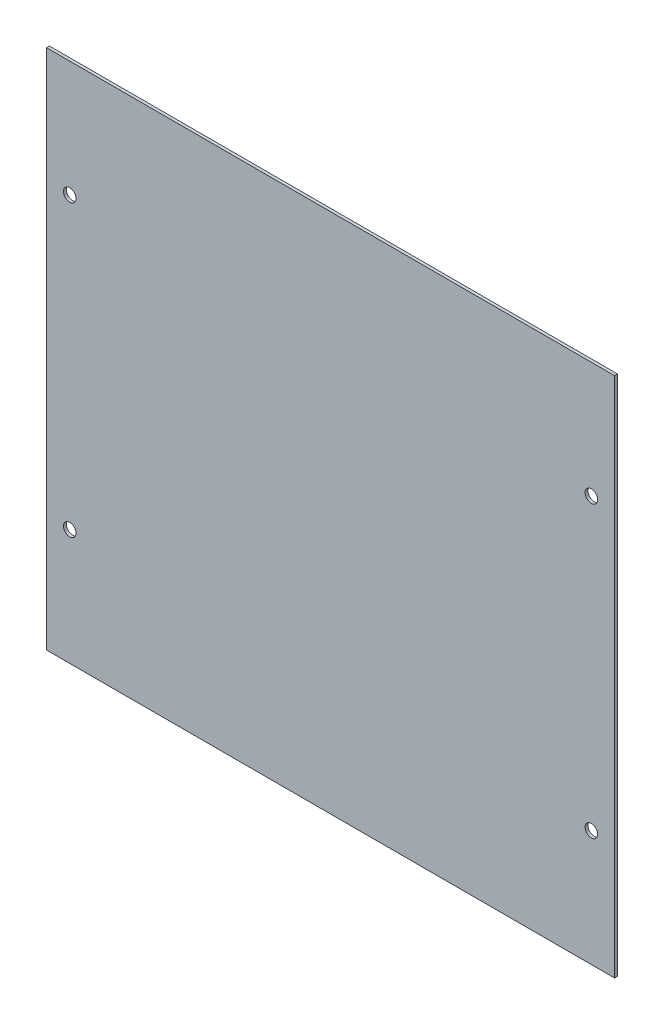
from build123d import *

# Parameters (mm, degrees)
SKETCH1_W                 = 294
SKETCH1_H                 = 270
BOSS_EXTRUDE1_DEPTH       = 1.5
SKETCH9_W                 = 3.25
SKETCH9_H                 = 2.7
DIAMETER_HOLE2_AT_2_COUNT = 2
DIAMETER_HOLE2_AT_2_PITCH = 150
DIAMETER_HOLE2_AT_3_COUNT = 2
DIAMETER_HOLE2_AT_3_PITCH = 270
DIAMETER_HOLE2_AT_4_COUNT = 2
DIAMETER_HOLE2_AT_4_PITCH = 308.86890423


with BuildPart() as part:
    # Sketch1 → Boss-Extrude1 (new body)
    with BuildSketch(Plane.XY):
        with Locations((147, 135)):
            Rectangle(SKETCH1_W, SKETCH1_H)
    extrude(amount=BOSS_EXTRUDE1_DEPTH)

    # Sketch9 → Diameter Hole2 (revolve, cut)
    with BuildSketch(Plane(origin=(12, 210, 1.5), x_dir=(0, -1, 0), z_dir=(1, 0, 0))):
        with Locations((1.625, 0.15)):
            Rectangle(SKETCH9_W, SKETCH9_H)
    diameter_hole2 = revolve(axis=Axis((12, 210, 2.7), (0, 0, -1)), mode=Mode.SUBTRACT)

    # Diameter Hole2 at 2: Diameter Hole2 ×2
    with Locations(*[(0, -i * DIAMETER_HOLE2_AT_2_PITCH, 0) for i in range(1, DIAMETER_HOLE2_AT_2_COUNT)]):
        add(diameter_hole2, mode=Mode.SUBTRACT)

    # Diameter Hole2 at 3: Diameter Hole2 ×2
    with Locations(*[(i * DIAMETER_HOLE2_AT_3_PITCH, 0, 0) for i in range(1, DIAMETER_HOLE2_AT_3_COUNT)]):
        add(diameter_hole2, mode=Mode.SUBTRACT)

    # Diameter Hole2 at 4: Diameter Hole2 ×2
    with Locations(*[Vector(0.8741572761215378, -0.485642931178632, 0) * (i * DIAMETER_HOLE2_AT_4_PITCH) for i in range(1, DIAMETER_HOLE2_AT_4_COUNT)]):
        add(diameter_hole2, mode=Mode.SUBTRACT)


solid = part.part
